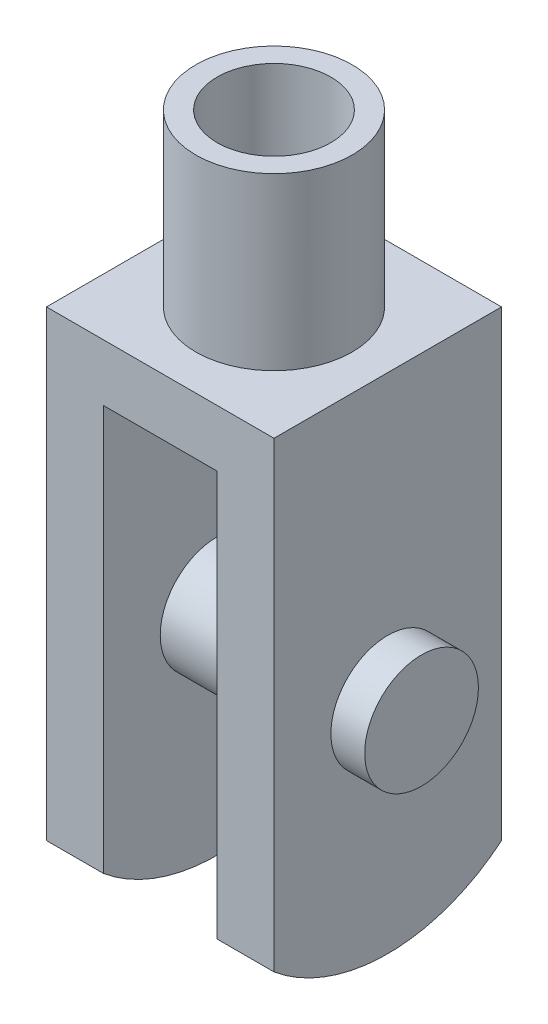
ISO-10303-21;
HEADER;
FILE_DESCRIPTION(('STEP AP214'),'2;1');
FILE_NAME('part.step','',(''),(''),'','','');
FILE_SCHEMA(('AUTOMOTIVE_DESIGN { 1 0 10303 214 1 1 1 1 }'));
ENDSEC;
DATA;
#1=APPLICATION_CONTEXT('core data for automotive mechanical design processes');
#2=APPLICATION_PROTOCOL_DEFINITION('international standard','automotive_design',2000,#1);
#3=PRODUCT_CONTEXT('',#1,'mechanical');
#4=PRODUCT('Part','Part','',(#3));
#5=PRODUCT_RELATED_PRODUCT_CATEGORY('part','',(#4));
#6=PRODUCT_DEFINITION_FORMATION('','',#4);
#7=PRODUCT_DEFINITION_CONTEXT('part definition',#1,'design');
#8=PRODUCT_DEFINITION('design','',#6,#7);
#9=PRODUCT_DEFINITION_SHAPE('','',#8);
#10=(LENGTH_UNIT() NAMED_UNIT(*) SI_UNIT(.MILLI.,.METRE.));
#11=(NAMED_UNIT(*) PLANE_ANGLE_UNIT() SI_UNIT($,.RADIAN.));
#12=(NAMED_UNIT(*) SI_UNIT($,.STERADIAN.) SOLID_ANGLE_UNIT());
#13=UNCERTAINTY_MEASURE_WITH_UNIT(LENGTH_MEASURE(1.E-05),#10,'distance_accuracy_value','');
#14=(GEOMETRIC_REPRESENTATION_CONTEXT(3) GLOBAL_UNCERTAINTY_ASSIGNED_CONTEXT((#13)) GLOBAL_UNIT_ASSIGNED_CONTEXT((#10,
#11,#12)) REPRESENTATION_CONTEXT('',''));
#15=CARTESIAN_POINT('',(0.,0.,0.));
#16=DIRECTION('',(0.,0.,1.));
#17=DIRECTION('',(1.,0.,0.));
#18=AXIS2_PLACEMENT_3D('',#15,#16,#17);
#19=CARTESIAN_POINT('',(-8.00000000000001,0.,16.));
#20=DIRECTION('',(0.,1.,0.));
#21=DIRECTION('',(-1.,0.,0.));
#22=AXIS2_PLACEMENT_3D('',#19,#20,#21);
#23=PLANE('',#22);
#24=DIRECTION('',(0.,0.,-1.));
#25=VECTOR('',#24,1.);
#26=CARTESIAN_POINT('',(-8.00000000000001,0.,16.));
#27=LINE('',#26,#25);
#28=CARTESIAN_POINT('',(-8.00000000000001,0.,16.));
#29=VERTEX_POINT('',#28);
#30=CARTESIAN_POINT('',(-8.00000000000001,0.,0.));
#31=VERTEX_POINT('',#30);
#32=EDGE_CURVE('E143',#29,#31,#27,.T.);
#33=ORIENTED_EDGE('',*,*,#32,.T.);
#34=CARTESIAN_POINT('',(0.,0.,0.));
#35=DIRECTION('',(0.,1.,0.));
#36=DIRECTION('',(-1.,0.,0.));
#37=AXIS2_PLACEMENT_3D('',#34,#35,#36);
#38=CIRCLE('',#37,8.);
#39=CARTESIAN_POINT('',(8.00000000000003,0.,0.));
#40=VERTEX_POINT('',#39);
#41=EDGE_CURVE('E190',#40,#31,#38,.F.);
#42=ORIENTED_EDGE('',*,*,#41,.F.);
#43=DIRECTION('',(0.,0.,-1.));
#44=VECTOR('',#43,1.);
#45=CARTESIAN_POINT('',(8.00000000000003,0.,16.));
#46=LINE('',#45,#44);
#47=CARTESIAN_POINT('',(8.00000000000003,0.,16.));
#48=VERTEX_POINT('',#47);
#49=EDGE_CURVE('E139',#48,#40,#46,.T.);
#50=ORIENTED_EDGE('',*,*,#49,.F.);
#51=DIRECTION('',(1.,0.,0.));
#52=VECTOR('',#51,1.);
#53=CARTESIAN_POINT('',(-8.00000000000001,0.,16.));
#54=LINE('',#53,#52);
#55=EDGE_CURVE('E111',#29,#48,#54,.T.);
#56=ORIENTED_EDGE('',*,*,#55,.F.);
#57=EDGE_LOOP('',(#33,#42,#50,#56));
#58=FACE_BOUND('',#57,.T.);
#59=ADVANCED_FACE('F17',(#58),#23,.F.);
#60=CARTESIAN_POINT('',(16.,7.99999999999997,16.));
#61=DIRECTION('',(0.,-1.,0.));
#62=DIRECTION('',(1.,0.,0.));
#63=AXIS2_PLACEMENT_3D('',#60,#61,#62);
#64=PLANE('',#63);
#65=DIRECTION('',(-1.,0.,0.));
#66=VECTOR('',#65,1.);
#67=CARTESIAN_POINT('',(16.,7.99999999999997,-16.));
#68=LINE('',#67,#66);
#69=CARTESIAN_POINT('',(16.,7.99999999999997,-16.));
#70=VERTEX_POINT('',#69);
#71=CARTESIAN_POINT('',(-16.,7.99999999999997,-16.));
#72=VERTEX_POINT('',#71);
#73=EDGE_CURVE('E129',#70,#72,#68,.T.);
#74=ORIENTED_EDGE('',*,*,#73,.T.);
#75=DIRECTION('',(0.,0.,-1.));
#76=VECTOR('',#75,1.);
#77=CARTESIAN_POINT('',(-16.,7.99999999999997,16.));
#78=LINE('',#77,#76);
#79=CARTESIAN_POINT('',(-16.,7.99999999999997,16.));
#80=VERTEX_POINT('',#79);
#81=EDGE_CURVE('E117',#80,#72,#78,.T.);
#82=ORIENTED_EDGE('',*,*,#81,.F.);
#83=DIRECTION('',(-1.,0.,0.));
#84=VECTOR('',#83,1.);
#85=CARTESIAN_POINT('',(16.,7.99999999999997,16.));
#86=LINE('',#85,#84);
#87=CARTESIAN_POINT('',(16.,7.99999999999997,16.));
#88=VERTEX_POINT('',#87);
#89=EDGE_CURVE('E107',#88,#80,#86,.T.);
#90=ORIENTED_EDGE('',*,*,#89,.F.);
#91=DIRECTION('',(0.,0.,-1.));
#92=VECTOR('',#91,1.);
#93=CARTESIAN_POINT('',(16.,7.99999999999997,16.));
#94=LINE('',#93,#92);
#95=EDGE_CURVE('E105',#88,#70,#94,.T.);
#96=ORIENTED_EDGE('',*,*,#95,.T.);
#97=EDGE_LOOP('',(#74,#82,#90,#96));
#98=FACE_BOUND('',#97,.T.);
#99=CARTESIAN_POINT('',(0.,7.99999999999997,0.));
#100=DIRECTION('',(0.,-1.,0.));
#101=DIRECTION('',(1.,0.,0.));
#102=AXIS2_PLACEMENT_3D('',#99,#100,#101);
#103=CIRCLE('',#102,11.);
#104=CARTESIAN_POINT('',(11.,7.99999999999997,0.));
#105=VERTEX_POINT('',#104);
#106=EDGE_CURVE('E25',#105,#105,#103,.F.);
#107=ORIENTED_EDGE('',*,*,#106,.F.);
#108=EDGE_LOOP('',(#107));
#109=FACE_BOUND('',#108,.T.);
#110=ADVANCED_FACE('F150',(#98,#109),#64,.F.);
#111=CARTESIAN_POINT('',(-8.00000000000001,0.,16.));
#112=DIRECTION('',(-1.,0.,0.));
#113=DIRECTION('',(0.,0.,1.));
#114=AXIS2_PLACEMENT_3D('',#111,#112,#113);
#115=PLANE('',#114);
#116=CARTESIAN_POINT('',(-8.00000000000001,-32.,0.));
#117=DIRECTION('',(-1.,0.,0.));
#118=DIRECTION('',(0.,0.,1.));
#119=AXIS2_PLACEMENT_3D('',#116,#117,#118);
#120=CIRCLE('',#119,8.);
#121=CARTESIAN_POINT('',(-8.00000000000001,-32.,8.));
#122=VERTEX_POINT('',#121);
#123=EDGE_CURVE('E92',#122,#122,#120,.F.);
#124=ORIENTED_EDGE('',*,*,#123,.F.);
#125=EDGE_LOOP('',(#124));
#126=FACE_BOUND('',#125,.T.);
#127=DIRECTION('',(0.,1.,0.));
#128=VECTOR('',#127,1.);
#129=CARTESIAN_POINT('',(-8.00000000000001,0.,16.));
#130=LINE('',#129,#128);
#131=CARTESIAN_POINT('',(-8.00000000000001,-57.,16.));
#132=VERTEX_POINT('',#131);
#133=EDGE_CURVE('E134',#132,#29,#130,.T.);
#134=ORIENTED_EDGE('',*,*,#133,.F.);
#135=CARTESIAN_POINT('',(-8.00000000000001,-37.7906272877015,0.));
#136=DIRECTION('',(-1.,0.,0.));
#137=DIRECTION('',(0.,0.,1.));
#138=AXIS2_PLACEMENT_3D('',#135,#136,#137);
#139=CIRCLE('',#138,25.);
#140=CARTESIAN_POINT('',(-8.00000000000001,-57.,-16.));
#141=VERTEX_POINT('',#140);
#142=EDGE_CURVE('E192',#132,#141,#139,.F.);
#143=ORIENTED_EDGE('',*,*,#142,.T.);
#144=DIRECTION('',(0.,1.,0.));
#145=VECTOR('',#144,1.);
#146=CARTESIAN_POINT('',(-8.00000000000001,0.,-16.));
#147=LINE('',#146,#145);
#148=CARTESIAN_POINT('',(-8.00000000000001,0.,-16.));
#149=VERTEX_POINT('',#148);
#150=EDGE_CURVE('E118',#141,#149,#147,.T.);
#151=ORIENTED_EDGE('',*,*,#150,.T.);
#152=EDGE_CURVE('E142',#31,#149,#27,.T.);
#153=ORIENTED_EDGE('',*,*,#152,.F.);
#154=ORIENTED_EDGE('',*,*,#32,.F.);
#155=EDGE_LOOP('',(#134,#143,#151,#153,#154));
#156=FACE_BOUND('',#155,.T.);
#157=ADVANCED_FACE('F19',(#126,#156),#115,.F.);
#158=CARTESIAN_POINT('',(8.00000000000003,0.,-16.));
#159=VERTEX_POINT('',#158);
#160=EDGE_CURVE('E138',#40,#159,#46,.T.);
#161=ORIENTED_EDGE('',*,*,#160,.F.);
#162=EDGE_CURVE('E181',#31,#40,#38,.F.);
#163=ORIENTED_EDGE('',*,*,#162,.F.);
#164=ORIENTED_EDGE('',*,*,#152,.T.);
#165=DIRECTION('',(1.,0.,0.));
#166=VECTOR('',#165,1.);
#167=CARTESIAN_POINT('',(-8.00000000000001,0.,-16.));
#168=LINE('',#167,#166);
#169=EDGE_CURVE('E120',#149,#159,#168,.T.);
#170=ORIENTED_EDGE('',*,*,#169,.T.);
#171=EDGE_LOOP('',(#161,#163,#164,#170));
#172=FACE_BOUND('',#171,.T.);
#173=ADVANCED_FACE('F160',(#172),#23,.F.);
#174=CARTESIAN_POINT('',(8.00000000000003,0.,16.));
#175=DIRECTION('',(1.,0.,0.));
#176=DIRECTION('',(0.,0.,-1.));
#177=AXIS2_PLACEMENT_3D('',#174,#175,#176);
#178=PLANE('',#177);
#179=CARTESIAN_POINT('',(8.00000000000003,-32.,0.));
#180=DIRECTION('',(1.,0.,0.));
#181=DIRECTION('',(0.,0.,-1.));
#182=AXIS2_PLACEMENT_3D('',#179,#180,#181);
#183=CIRCLE('',#182,8.);
#184=CARTESIAN_POINT('',(8.00000000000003,-32.,-8.));
#185=VERTEX_POINT('',#184);
#186=EDGE_CURVE('E218',#185,#185,#183,.F.);
#187=ORIENTED_EDGE('',*,*,#186,.F.);
#188=EDGE_LOOP('',(#187));
#189=FACE_BOUND('',#188,.T.);
#190=DIRECTION('',(0.,-1.,0.));
#191=VECTOR('',#190,1.);
#192=CARTESIAN_POINT('',(8.00000000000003,0.,-16.));
#193=LINE('',#192,#191);
#194=CARTESIAN_POINT('',(8.00000000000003,-57.,-16.));
#195=VERTEX_POINT('',#194);
#196=EDGE_CURVE('E124',#159,#195,#193,.T.);
#197=ORIENTED_EDGE('',*,*,#196,.T.);
#198=CARTESIAN_POINT('',(8.00000000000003,-37.7906272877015,0.));
#199=DIRECTION('',(1.,0.,0.));
#200=DIRECTION('',(0.,0.,-1.));
#201=AXIS2_PLACEMENT_3D('',#198,#199,#200);
#202=CIRCLE('',#201,25.);
#203=CARTESIAN_POINT('',(8.00000000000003,-57.,16.));
#204=VERTEX_POINT('',#203);
#205=EDGE_CURVE('E32',#195,#204,#202,.F.);
#206=ORIENTED_EDGE('',*,*,#205,.T.);
#207=DIRECTION('',(0.,-1.,0.));
#208=VECTOR('',#207,1.);
#209=CARTESIAN_POINT('',(8.00000000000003,0.,16.));
#210=LINE('',#209,#208);
#211=EDGE_CURVE('E100',#48,#204,#210,.T.);
#212=ORIENTED_EDGE('',*,*,#211,.F.);
#213=ORIENTED_EDGE('',*,*,#49,.T.);
#214=ORIENTED_EDGE('',*,*,#160,.T.);
#215=EDGE_LOOP('',(#197,#206,#212,#213,#214));
#216=FACE_BOUND('',#215,.T.);
#217=ADVANCED_FACE('F169',(#189,#216),#178,.F.);
#218=CARTESIAN_POINT('',(16.,-64.,16.));
#219=DIRECTION('',(-1.,0.,0.));
#220=DIRECTION('',(0.,0.,1.));
#221=AXIS2_PLACEMENT_3D('',#218,#219,#220);
#222=PLANE('',#221);
#223=CARTESIAN_POINT('',(16.,-32.,0.));
#224=DIRECTION('',(1.,0.,0.));
#225=DIRECTION('',(0.,0.,-1.));
#226=AXIS2_PLACEMENT_3D('',#223,#224,#225);
#227=CIRCLE('',#226,8.);
#228=CARTESIAN_POINT('',(16.,-32.,-8.));
#229=VERTEX_POINT('',#228);
#230=EDGE_CURVE('E121',#229,#229,#227,.T.);
#231=ORIENTED_EDGE('',*,*,#230,.F.);
#232=EDGE_LOOP('',(#231));
#233=FACE_BOUND('',#232,.T.);
#234=DIRECTION('',(0.,1.,0.));
#235=VECTOR('',#234,1.);
#236=CARTESIAN_POINT('',(16.,-64.,16.));
#237=LINE('',#236,#235);
#238=CARTESIAN_POINT('',(16.,-57.,16.));
#239=VERTEX_POINT('',#238);
#240=EDGE_CURVE('E97',#239,#88,#237,.T.);
#241=ORIENTED_EDGE('',*,*,#240,.F.);
#242=CARTESIAN_POINT('',(16.,-37.7906272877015,0.));
#243=DIRECTION('',(-1.,0.,0.));
#244=DIRECTION('',(0.,0.,-1.));
#245=AXIS2_PLACEMENT_3D('',#242,#243,#244);
#246=CIRCLE('',#245,25.);
#247=CARTESIAN_POINT('',(16.,-57.,-16.));
#248=VERTEX_POINT('',#247);
#249=EDGE_CURVE('E85',#248,#239,#246,.T.);
#250=ORIENTED_EDGE('',*,*,#249,.F.);
#251=DIRECTION('',(0.,1.,0.));
#252=VECTOR('',#251,1.);
#253=CARTESIAN_POINT('',(16.,-64.,-16.));
#254=LINE('',#253,#252);
#255=EDGE_CURVE('E127',#248,#70,#254,.T.);
#256=ORIENTED_EDGE('',*,*,#255,.T.);
#257=ORIENTED_EDGE('',*,*,#95,.F.);
#258=EDGE_LOOP('',(#241,#250,#256,#257));
#259=FACE_BOUND('',#258,.T.);
#260=ADVANCED_FACE('F103',(#233,#259),#222,.F.);
#261=CARTESIAN_POINT('',(-16.,7.99999999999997,16.));
#262=DIRECTION('',(1.,0.,0.));
#263=DIRECTION('',(0.,1.,0.));
#264=AXIS2_PLACEMENT_3D('',#261,#262,#263);
#265=PLANE('',#264);
#266=CARTESIAN_POINT('',(-16.,-32.,0.));
#267=DIRECTION('',(1.,0.,0.));
#268=DIRECTION('',(0.,1.,0.));
#269=AXIS2_PLACEMENT_3D('',#266,#267,#268);
#270=CIRCLE('',#269,8.);
#271=CARTESIAN_POINT('',(-16.,-24.,0.));
#272=VERTEX_POINT('',#271);
#273=EDGE_CURVE('E221',#272,#272,#270,.F.);
#274=ORIENTED_EDGE('',*,*,#273,.F.);
#275=EDGE_LOOP('',(#274));
#276=FACE_BOUND('',#275,.T.);
#277=DIRECTION('',(0.,-1.,0.));
#278=VECTOR('',#277,1.);
#279=CARTESIAN_POINT('',(-16.,7.99999999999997,-16.));
#280=LINE('',#279,#278);
#281=CARTESIAN_POINT('',(-16.,-57.,-16.));
#282=VERTEX_POINT('',#281);
#283=EDGE_CURVE('E131',#72,#282,#280,.T.);
#284=ORIENTED_EDGE('',*,*,#283,.T.);
#285=CARTESIAN_POINT('',(-16.,-37.7906272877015,0.));
#286=DIRECTION('',(-1.,0.,0.));
#287=DIRECTION('',(0.,0.,-1.));
#288=AXIS2_PLACEMENT_3D('',#285,#286,#287);
#289=CIRCLE('',#288,25.);
#290=CARTESIAN_POINT('',(-16.,-57.,16.));
#291=VERTEX_POINT('',#290);
#292=EDGE_CURVE('E39',#282,#291,#289,.T.);
#293=ORIENTED_EDGE('',*,*,#292,.T.);
#294=DIRECTION('',(0.,-1.,0.));
#295=VECTOR('',#294,1.);
#296=CARTESIAN_POINT('',(-16.,7.99999999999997,16.));
#297=LINE('',#296,#295);
#298=EDGE_CURVE('E109',#80,#291,#297,.T.);
#299=ORIENTED_EDGE('',*,*,#298,.F.);
#300=ORIENTED_EDGE('',*,*,#81,.T.);
#301=EDGE_LOOP('',(#284,#293,#299,#300));
#302=FACE_BOUND('',#301,.T.);
#303=ADVANCED_FACE('F165',(#276,#302),#265,.F.);
#304=CARTESIAN_POINT('',(-8.00000000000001,-64.,16.));
#305=DIRECTION('',(0.,0.,1.));
#306=DIRECTION('',(1.,0.,0.));
#307=AXIS2_PLACEMENT_3D('',#304,#305,#306);
#308=PLANE('',#307);
#309=DIRECTION('',(1.,0.,0.));
#310=VECTOR('',#309,1.);
#311=CARTESIAN_POINT('',(-16.,-57.,16.));
#312=LINE('',#311,#310);
#313=EDGE_CURVE('E88',#204,#239,#312,.T.);
#314=ORIENTED_EDGE('',*,*,#313,.T.);
#315=ORIENTED_EDGE('',*,*,#240,.T.);
#316=ORIENTED_EDGE('',*,*,#89,.T.);
#317=ORIENTED_EDGE('',*,*,#298,.T.);
#318=EDGE_CURVE('E101',#291,#132,#312,.T.);
#319=ORIENTED_EDGE('',*,*,#318,.T.);
#320=ORIENTED_EDGE('',*,*,#133,.T.);
#321=ORIENTED_EDGE('',*,*,#55,.T.);
#322=ORIENTED_EDGE('',*,*,#211,.T.);
#323=EDGE_LOOP('',(#314,#315,#316,#317,#319,#320,#321,#322));
#324=FACE_BOUND('',#323,.T.);
#325=ADVANCED_FACE('F96',(#324),#308,.T.);
#326=CARTESIAN_POINT('',(-8.00000000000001,-64.,-16.));
#327=DIRECTION('',(0.,0.,1.));
#328=DIRECTION('',(1.,0.,0.));
#329=AXIS2_PLACEMENT_3D('',#326,#327,#328);
#330=PLANE('',#329);
#331=ORIENTED_EDGE('',*,*,#255,.F.);
#332=DIRECTION('',(1.,0.,0.));
#333=VECTOR('',#332,1.);
#334=CARTESIAN_POINT('',(-16.,-57.,-16.));
#335=LINE('',#334,#333);
#336=EDGE_CURVE('E11',#248,#195,#335,.F.);
#337=ORIENTED_EDGE('',*,*,#336,.T.);
#338=ORIENTED_EDGE('',*,*,#196,.F.);
#339=ORIENTED_EDGE('',*,*,#169,.F.);
#340=ORIENTED_EDGE('',*,*,#150,.F.);
#341=DIRECTION('',(1.,0.,0.));
#342=VECTOR('',#341,1.);
#343=CARTESIAN_POINT('',(-16.,-57.,-16.));
#344=LINE('',#343,#342);
#345=EDGE_CURVE('E212',#282,#141,#344,.T.);
#346=ORIENTED_EDGE('',*,*,#345,.F.);
#347=ORIENTED_EDGE('',*,*,#283,.F.);
#348=ORIENTED_EDGE('',*,*,#73,.F.);
#349=EDGE_LOOP('',(#331,#337,#338,#339,#340,#346,#347,#348));
#350=FACE_BOUND('',#349,.T.);
#351=ADVANCED_FACE('F211',(#350),#330,.F.);
#352=CARTESIAN_POINT('',(0.,8.32249047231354,0.));
#353=DIRECTION('',(0.,1.,0.));
#354=DIRECTION('',(0.,0.,1.));
#355=AXIS2_PLACEMENT_3D('',#352,#353,#354);
#356=CYLINDRICAL_SURFACE('',#355,8.);
#357=CARTESIAN_POINT('',(0.,32.,0.));
#358=DIRECTION('',(0.,1.,0.));
#359=DIRECTION('',(0.,0.,1.));
#360=AXIS2_PLACEMENT_3D('',#357,#358,#359);
#361=CIRCLE('',#360,8.);
#362=CARTESIAN_POINT('',(0.,32.,8.));
#363=VERTEX_POINT('',#362);
#364=EDGE_CURVE('E201',#363,#363,#361,.T.);
#365=ORIENTED_EDGE('',*,*,#364,.T.);
#366=EDGE_LOOP('',(#365));
#367=FACE_BOUND('',#366,.T.);
#368=ORIENTED_EDGE('',*,*,#162,.T.);
#369=ORIENTED_EDGE('',*,*,#41,.T.);
#370=EDGE_LOOP('',(#368,#369));
#371=FACE_BOUND('',#370,.T.);
#372=ADVANCED_FACE('F280',(#367,#371),#356,.F.);
#373=CARTESIAN_POINT('',(8.,32.,0.));
#374=DIRECTION('',(0.,-1.,0.));
#375=DIRECTION('',(0.,0.,-1.));
#376=AXIS2_PLACEMENT_3D('',#373,#374,#375);
#377=PLANE('',#376);
#378=ORIENTED_EDGE('',*,*,#364,.F.);
#379=EDGE_LOOP('',(#378));
#380=FACE_BOUND('',#379,.T.);
#381=CARTESIAN_POINT('',(0.,32.,0.));
#382=DIRECTION('',(0.,1.,0.));
#383=DIRECTION('',(0.,0.,1.));
#384=AXIS2_PLACEMENT_3D('',#381,#382,#383);
#385=CIRCLE('',#384,11.);
#386=CARTESIAN_POINT('',(0.,32.,11.));
#387=VERTEX_POINT('',#386);
#388=EDGE_CURVE('E194',#387,#387,#385,.T.);
#389=ORIENTED_EDGE('',*,*,#388,.T.);
#390=EDGE_LOOP('',(#389));
#391=FACE_BOUND('',#390,.T.);
#392=ADVANCED_FACE('F274',(#380,#391),#377,.F.);
#393=CARTESIAN_POINT('',(0.,8.32249047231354,0.));
#394=DIRECTION('',(0.,1.,0.));
#395=DIRECTION('',(0.,0.,1.));
#396=AXIS2_PLACEMENT_3D('',#393,#394,#395);
#397=CYLINDRICAL_SURFACE('',#396,11.);
#398=ORIENTED_EDGE('',*,*,#388,.F.);
#399=EDGE_LOOP('',(#398));
#400=FACE_BOUND('',#399,.T.);
#401=ORIENTED_EDGE('',*,*,#106,.T.);
#402=EDGE_LOOP('',(#401));
#403=FACE_BOUND('',#402,.T.);
#404=ADVANCED_FACE('F148',(#400,#403),#397,.T.);
#405=CARTESIAN_POINT('',(-16.,-37.7906272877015,0.));
#406=DIRECTION('',(1.,0.,0.));
#407=DIRECTION('',(0.,0.,-1.));
#408=AXIS2_PLACEMENT_3D('',#405,#406,#407);
#409=CYLINDRICAL_SURFACE('',#408,25.);
#410=ORIENTED_EDGE('',*,*,#318,.F.);
#411=ORIENTED_EDGE('',*,*,#292,.F.);
#412=ORIENTED_EDGE('',*,*,#345,.T.);
#413=ORIENTED_EDGE('',*,*,#142,.F.);
#414=EDGE_LOOP('',(#410,#411,#412,#413));
#415=FACE_BOUND('',#414,.T.);
#416=ADVANCED_FACE('F267',(#415),#409,.T.);
#417=ORIENTED_EDGE('',*,*,#336,.F.);
#418=ORIENTED_EDGE('',*,*,#249,.T.);
#419=ORIENTED_EDGE('',*,*,#313,.F.);
#420=ORIENTED_EDGE('',*,*,#205,.F.);
#421=EDGE_LOOP('',(#417,#418,#419,#420));
#422=FACE_BOUND('',#421,.T.);
#423=ADVANCED_FACE('F87',(#422),#409,.T.);
#424=CARTESIAN_POINT('',(-20.75,-32.,0.));
#425=DIRECTION('',(1.,0.,0.));
#426=DIRECTION('',(0.,0.,-1.));
#427=AXIS2_PLACEMENT_3D('',#424,#425,#426);
#428=PLANE('',#427);
#429=CARTESIAN_POINT('',(-20.75,-32.,0.));
#430=DIRECTION('',(1.,0.,0.));
#431=DIRECTION('',(0.,0.,-1.));
#432=AXIS2_PLACEMENT_3D('',#429,#430,#431);
#433=CIRCLE('',#432,8.);
#434=CARTESIAN_POINT('',(-20.75,-32.,-8.));
#435=VERTEX_POINT('',#434);
#436=EDGE_CURVE('E225',#435,#435,#433,.T.);
#437=ORIENTED_EDGE('',*,*,#436,.F.);
#438=EDGE_LOOP('',(#437));
#439=FACE_BOUND('',#438,.T.);
#440=ADVANCED_FACE('F250',(#439),#428,.F.);
#441=CARTESIAN_POINT('',(20.75,-32.,0.));
#442=DIRECTION('',(-1.,0.,0.));
#443=DIRECTION('',(0.,0.,1.));
#444=AXIS2_PLACEMENT_3D('',#441,#442,#443);
#445=CYLINDRICAL_SURFACE('',#444,8.);
#446=ORIENTED_EDGE('',*,*,#436,.T.);
#447=EDGE_LOOP('',(#446));
#448=FACE_BOUND('',#447,.T.);
#449=ORIENTED_EDGE('',*,*,#273,.T.);
#450=EDGE_LOOP('',(#449));
#451=FACE_BOUND('',#450,.T.);
#452=ADVANCED_FACE('F238',(#448,#451),#445,.T.);
#453=CARTESIAN_POINT('',(20.75,-32.,0.));
#454=DIRECTION('',(1.,0.,0.));
#455=DIRECTION('',(0.,0.,-1.));
#456=AXIS2_PLACEMENT_3D('',#453,#454,#455);
#457=PLANE('',#456);
#458=CARTESIAN_POINT('',(20.75,-32.,0.));
#459=DIRECTION('',(1.,0.,0.));
#460=DIRECTION('',(0.,0.,-1.));
#461=AXIS2_PLACEMENT_3D('',#458,#459,#460);
#462=CIRCLE('',#461,8.);
#463=CARTESIAN_POINT('',(20.75,-32.,-8.));
#464=VERTEX_POINT('',#463);
#465=EDGE_CURVE('E224',#464,#464,#462,.T.);
#466=ORIENTED_EDGE('',*,*,#465,.T.);
#467=EDGE_LOOP('',(#466));
#468=FACE_BOUND('',#467,.T.);
#469=ADVANCED_FACE('F231',(#468),#457,.T.);
#470=ORIENTED_EDGE('',*,*,#465,.F.);
#471=EDGE_LOOP('',(#470));
#472=FACE_BOUND('',#471,.T.);
#473=ORIENTED_EDGE('',*,*,#230,.T.);
#474=EDGE_LOOP('',(#473));
#475=FACE_BOUND('',#474,.T.);
#476=ADVANCED_FACE('F233',(#472,#475),#445,.T.);
#477=ORIENTED_EDGE('',*,*,#186,.T.);
#478=EDGE_LOOP('',(#477));
#479=FACE_BOUND('',#478,.T.);
#480=ORIENTED_EDGE('',*,*,#123,.T.);
#481=EDGE_LOOP('',(#480));
#482=FACE_BOUND('',#481,.T.);
#483=ADVANCED_FACE('F236',(#479,#482),#445,.T.);
#484=CLOSED_SHELL('',(#59,#110,#157,#173,#217,#260,#303,#325,#351,#372,#392,#404,#416,#423,#440,
#452,#469,#476,#483));
#485=MANIFOLD_SOLID_BREP('B1',#484);
#486=ADVANCED_BREP_SHAPE_REPRESENTATION('',(#18,#485),#14);
#487=SHAPE_DEFINITION_REPRESENTATION(#9,#486);
ENDSEC;
END-ISO-10303-21;
